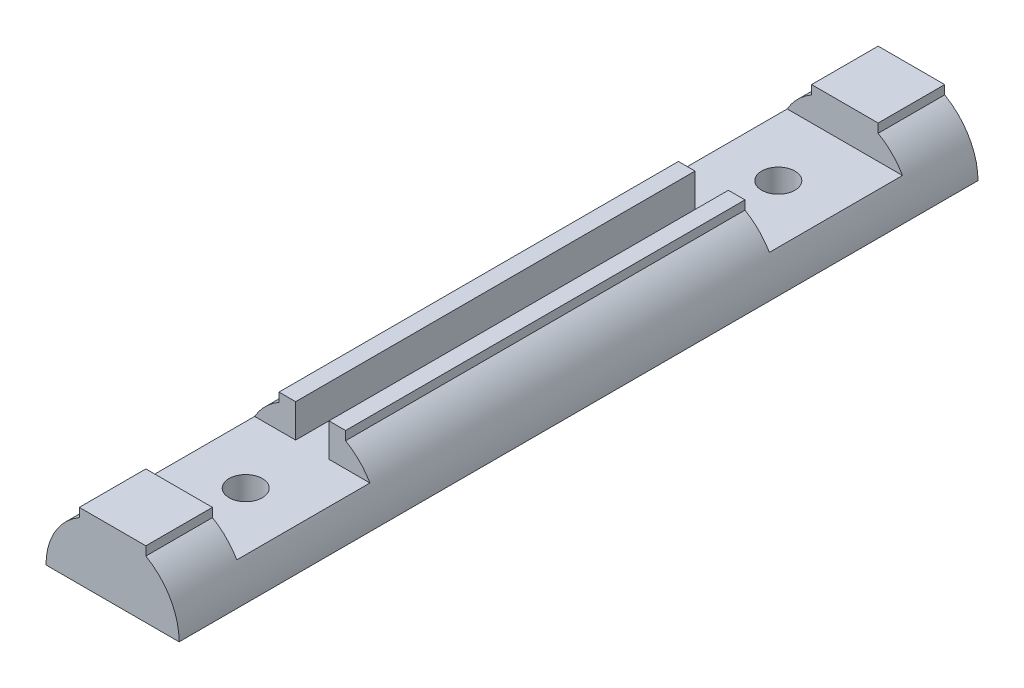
ISO-10303-21;
HEADER;
FILE_DESCRIPTION(('STEP AP214'),'2;1');
FILE_NAME('part.step','',(''),(''),'','','');
FILE_SCHEMA(('AUTOMOTIVE_DESIGN { 1 0 10303 214 1 1 1 1 }'));
ENDSEC;
DATA;
#1=APPLICATION_CONTEXT('core data for automotive mechanical design processes');
#2=APPLICATION_PROTOCOL_DEFINITION('international standard','automotive_design',2000,#1);
#3=PRODUCT_CONTEXT('',#1,'mechanical');
#4=PRODUCT('Part','Part','',(#3));
#5=PRODUCT_RELATED_PRODUCT_CATEGORY('part','',(#4));
#6=PRODUCT_DEFINITION_FORMATION('','',#4);
#7=PRODUCT_DEFINITION_CONTEXT('part definition',#1,'design');
#8=PRODUCT_DEFINITION('design','',#6,#7);
#9=PRODUCT_DEFINITION_SHAPE('','',#8);
#10=(LENGTH_UNIT() NAMED_UNIT(*) SI_UNIT(.MILLI.,.METRE.));
#11=(NAMED_UNIT(*) PLANE_ANGLE_UNIT() SI_UNIT($,.RADIAN.));
#12=(NAMED_UNIT(*) SI_UNIT($,.STERADIAN.) SOLID_ANGLE_UNIT());
#13=UNCERTAINTY_MEASURE_WITH_UNIT(LENGTH_MEASURE(1.E-05),#10,'distance_accuracy_value','');
#14=(GEOMETRIC_REPRESENTATION_CONTEXT(3) GLOBAL_UNCERTAINTY_ASSIGNED_CONTEXT((#13)) GLOBAL_UNIT_ASSIGNED_CONTEXT((#10,
#11,#12)) REPRESENTATION_CONTEXT('',''));
#15=CARTESIAN_POINT('',(0.,0.,0.));
#16=DIRECTION('',(0.,0.,1.));
#17=DIRECTION('',(1.,0.,0.));
#18=AXIS2_PLACEMENT_3D('',#15,#16,#17);
#19=CARTESIAN_POINT('',(5.,10.,-82.3606797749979));
#20=DIRECTION('',(0.,1.,0.));
#21=DIRECTION('',(0.,0.,1.));
#22=AXIS2_PLACEMENT_3D('',#19,#20,#21);
#23=PLANE('',#22);
#24=DIRECTION('',(0.,0.,-1.));
#25=VECTOR('',#24,1.);
#26=CARTESIAN_POINT('',(2.5,10.,30.));
#27=LINE('',#26,#25);
#28=CARTESIAN_POINT('',(2.5,10.,30.));
#29=VERTEX_POINT('',#28);
#30=CARTESIAN_POINT('',(2.5,10.,-30.));
#31=VERTEX_POINT('',#30);
#32=EDGE_CURVE('E239',#29,#31,#27,.T.);
#33=ORIENTED_EDGE('',*,*,#32,.F.);
#34=DIRECTION('',(-1.,0.,0.));
#35=VECTOR('',#34,1.);
#36=CARTESIAN_POINT('',(8.66025403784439,10.,30.));
#37=LINE('',#36,#35);
#38=CARTESIAN_POINT('',(5.,10.,30.));
#39=VERTEX_POINT('',#38);
#40=EDGE_CURVE('E227',#39,#29,#37,.T.);
#41=ORIENTED_EDGE('',*,*,#40,.F.);
#42=DIRECTION('',(0.,0.,1.));
#43=VECTOR('',#42,1.);
#44=CARTESIAN_POINT('',(5.,10.,-82.3606797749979));
#45=LINE('',#44,#43);
#46=CARTESIAN_POINT('',(5.,10.,-30.));
#47=VERTEX_POINT('',#46);
#48=EDGE_CURVE('E238',#47,#39,#45,.T.);
#49=ORIENTED_EDGE('',*,*,#48,.F.);
#50=DIRECTION('',(-1.,0.,0.));
#51=VECTOR('',#50,1.);
#52=CARTESIAN_POINT('',(8.66025403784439,10.,-30.));
#53=LINE('',#52,#51);
#54=EDGE_CURVE('E352',#47,#31,#53,.T.);
#55=ORIENTED_EDGE('',*,*,#54,.T.);
#56=EDGE_LOOP('',(#33,#41,#49,#55));
#57=FACE_BOUND('',#56,.T.);
#58=ADVANCED_FACE('F33',(#57),#23,.T.);
#59=CARTESIAN_POINT('',(0.,0.,-30.));
#60=DIRECTION('',(0.,0.,1.));
#61=DIRECTION('',(1.,0.,0.));
#62=AXIS2_PLACEMENT_3D('',#59,#60,#61);
#63=PLANE('',#62);
#64=DIRECTION('',(1.,0.,0.));
#65=VECTOR('',#64,1.);
#66=CARTESIAN_POINT('',(8.66025403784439,5.,-30.));
#67=LINE('',#66,#65);
#68=CARTESIAN_POINT('',(2.5,5.,-30.));
#69=VERTEX_POINT('',#68);
#70=CARTESIAN_POINT('',(8.66025403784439,5.,-30.));
#71=VERTEX_POINT('',#70);
#72=EDGE_CURVE('E347',#69,#71,#67,.T.);
#73=ORIENTED_EDGE('',*,*,#72,.F.);
#74=DIRECTION('',(0.,1.,0.));
#75=VECTOR('',#74,1.);
#76=CARTESIAN_POINT('',(2.5,-55.2079728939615,-30.));
#77=LINE('',#76,#75);
#78=EDGE_CURVE('E311',#69,#31,#77,.T.);
#79=ORIENTED_EDGE('',*,*,#78,.T.);
#80=ORIENTED_EDGE('',*,*,#54,.F.);
#81=DIRECTION('',(0.,-1.,0.));
#82=VECTOR('',#81,1.);
#83=CARTESIAN_POINT('',(5.,-10.,-30.));
#84=LINE('',#83,#82);
#85=CARTESIAN_POINT('',(5.,8.66025403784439,-30.));
#86=VERTEX_POINT('',#85);
#87=EDGE_CURVE('E215',#47,#86,#84,.T.);
#88=ORIENTED_EDGE('',*,*,#87,.T.);
#89=CARTESIAN_POINT('',(0.,0.,-30.));
#90=DIRECTION('',(0.,0.,1.));
#91=DIRECTION('',(1.,0.,0.));
#92=AXIS2_PLACEMENT_3D('',#89,#90,#91);
#93=CIRCLE('',#92,10.);
#94=EDGE_CURVE('E363',#71,#86,#93,.T.);
#95=ORIENTED_EDGE('',*,*,#94,.F.);
#96=EDGE_LOOP('',(#73,#79,#80,#88,#95));
#97=FACE_BOUND('',#96,.T.);
#98=ADVANCED_FACE('F407',(#97),#63,.F.);
#99=CARTESIAN_POINT('',(0.,0.,30.));
#100=DIRECTION('',(0.,0.,-1.));
#101=DIRECTION('',(1.,0.,0.));
#102=AXIS2_PLACEMENT_3D('',#99,#100,#101);
#103=PLANE('',#102);
#104=ORIENTED_EDGE('',*,*,#40,.T.);
#105=DIRECTION('',(0.,1.,0.));
#106=VECTOR('',#105,1.);
#107=CARTESIAN_POINT('',(2.5,-55.2079728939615,30.));
#108=LINE('',#107,#106);
#109=CARTESIAN_POINT('',(2.5,5.,30.));
#110=VERTEX_POINT('',#109);
#111=EDGE_CURVE('E302',#110,#29,#108,.T.);
#112=ORIENTED_EDGE('',*,*,#111,.F.);
#113=DIRECTION('',(1.,0.,0.));
#114=VECTOR('',#113,1.);
#115=CARTESIAN_POINT('',(8.66025403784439,5.,30.));
#116=LINE('',#115,#114);
#117=CARTESIAN_POINT('',(8.66025403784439,5.,30.));
#118=VERTEX_POINT('',#117);
#119=EDGE_CURVE('E240',#110,#118,#116,.T.);
#120=ORIENTED_EDGE('',*,*,#119,.T.);
#121=CARTESIAN_POINT('',(0.,0.,30.));
#122=DIRECTION('',(0.,0.,-1.));
#123=DIRECTION('',(-1.,0.,0.));
#124=AXIS2_PLACEMENT_3D('',#121,#122,#123);
#125=CIRCLE('',#124,10.);
#126=CARTESIAN_POINT('',(5.,8.66025403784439,30.));
#127=VERTEX_POINT('',#126);
#128=EDGE_CURVE('E229',#127,#118,#125,.T.);
#129=ORIENTED_EDGE('',*,*,#128,.F.);
#130=DIRECTION('',(0.,1.,0.));
#131=VECTOR('',#130,1.);
#132=CARTESIAN_POINT('',(5.,-10.,30.));
#133=LINE('',#132,#131);
#134=EDGE_CURVE('E42',#127,#39,#133,.T.);
#135=ORIENTED_EDGE('',*,*,#134,.T.);
#136=EDGE_LOOP('',(#104,#112,#120,#129,#135));
#137=FACE_BOUND('',#136,.T.);
#138=ADVANCED_FACE('F225',(#137),#103,.F.);
#139=CARTESIAN_POINT('',(0.,0.,60.));
#140=DIRECTION('',(0.,0.,-1.));
#141=DIRECTION('',(-1.,0.,0.));
#142=AXIS2_PLACEMENT_3D('',#139,#140,#141);
#143=CYLINDRICAL_SURFACE('',#142,10.);
#144=CARTESIAN_POINT('',(0.,0.,-60.));
#145=DIRECTION('',(0.,0.,1.));
#146=DIRECTION('',(1.,0.,0.));
#147=AXIS2_PLACEMENT_3D('',#144,#145,#146);
#148=CIRCLE('',#147,10.);
#149=CARTESIAN_POINT('',(-5.,8.66025403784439,-60.));
#150=VERTEX_POINT('',#149);
#151=CARTESIAN_POINT('',(-10.,0.,-60.));
#152=VERTEX_POINT('',#151);
#153=EDGE_CURVE('E206',#150,#152,#148,.T.);
#154=ORIENTED_EDGE('',*,*,#153,.T.);
#155=DIRECTION('',(0.,0.,1.));
#156=VECTOR('',#155,1.);
#157=CARTESIAN_POINT('',(-10.,0.,-60.));
#158=LINE('',#157,#156);
#159=CARTESIAN_POINT('',(-10.,0.,60.));
#160=VERTEX_POINT('',#159);
#161=EDGE_CURVE('E49',#152,#160,#158,.T.);
#162=ORIENTED_EDGE('',*,*,#161,.T.);
#163=CARTESIAN_POINT('',(0.,0.,60.));
#164=DIRECTION('',(0.,0.,1.));
#165=DIRECTION('',(1.,0.,0.));
#166=AXIS2_PLACEMENT_3D('',#163,#164,#165);
#167=CIRCLE('',#166,10.);
#168=CARTESIAN_POINT('',(-5.,8.66025403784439,60.));
#169=VERTEX_POINT('',#168);
#170=EDGE_CURVE('E218',#169,#160,#167,.T.);
#171=ORIENTED_EDGE('',*,*,#170,.F.);
#172=DIRECTION('',(0.,0.,-1.));
#173=VECTOR('',#172,1.);
#174=CARTESIAN_POINT('',(-5.,8.66025403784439,60.));
#175=LINE('',#174,#173);
#176=CARTESIAN_POINT('',(-5.,8.66025403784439,50.));
#177=VERTEX_POINT('',#176);
#178=EDGE_CURVE('E207',#169,#177,#175,.T.);
#179=ORIENTED_EDGE('',*,*,#178,.T.);
#180=CARTESIAN_POINT('',(0.,0.,50.));
#181=DIRECTION('',(0.,0.,-1.));
#182=DIRECTION('',(-1.,0.,0.));
#183=AXIS2_PLACEMENT_3D('',#180,#181,#182);
#184=CIRCLE('',#183,10.);
#185=CARTESIAN_POINT('',(-8.66025403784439,5.,50.));
#186=VERTEX_POINT('',#185);
#187=EDGE_CURVE('E294',#186,#177,#184,.T.);
#188=ORIENTED_EDGE('',*,*,#187,.F.);
#189=DIRECTION('',(0.,0.,-1.));
#190=VECTOR('',#189,1.);
#191=CARTESIAN_POINT('',(-8.66025403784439,5.,50.));
#192=LINE('',#191,#190);
#193=CARTESIAN_POINT('',(-8.66025403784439,5.,30.));
#194=VERTEX_POINT('',#193);
#195=EDGE_CURVE('E330',#186,#194,#192,.T.);
#196=ORIENTED_EDGE('',*,*,#195,.T.);
#197=CARTESIAN_POINT('',(0.,0.,30.));
#198=DIRECTION('',(0.,0.,-1.));
#199=DIRECTION('',(-1.,0.,0.));
#200=AXIS2_PLACEMENT_3D('',#197,#198,#199);
#201=CIRCLE('',#200,10.);
#202=CARTESIAN_POINT('',(-5.,8.66025403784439,30.));
#203=VERTEX_POINT('',#202);
#204=EDGE_CURVE('E337',#194,#203,#201,.T.);
#205=ORIENTED_EDGE('',*,*,#204,.T.);
#206=CARTESIAN_POINT('',(-5.,8.66025403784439,-30.));
#207=VERTEX_POINT('',#206);
#208=EDGE_CURVE('E210',#203,#207,#175,.T.);
#209=ORIENTED_EDGE('',*,*,#208,.T.);
#210=CARTESIAN_POINT('',(0.,0.,-30.));
#211=DIRECTION('',(0.,0.,1.));
#212=DIRECTION('',(1.,0.,0.));
#213=AXIS2_PLACEMENT_3D('',#210,#211,#212);
#214=CIRCLE('',#213,10.);
#215=CARTESIAN_POINT('',(-8.66025403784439,5.,-30.));
#216=VERTEX_POINT('',#215);
#217=EDGE_CURVE('E370',#207,#216,#214,.T.);
#218=ORIENTED_EDGE('',*,*,#217,.T.);
#219=DIRECTION('',(0.,0.,1.));
#220=VECTOR('',#219,1.);
#221=CARTESIAN_POINT('',(-8.66025403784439,5.,-50.));
#222=LINE('',#221,#220);
#223=CARTESIAN_POINT('',(-8.66025403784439,5.,-50.));
#224=VERTEX_POINT('',#223);
#225=EDGE_CURVE('E354',#224,#216,#222,.T.);
#226=ORIENTED_EDGE('',*,*,#225,.F.);
#227=CARTESIAN_POINT('',(0.,0.,-50.));
#228=DIRECTION('',(0.,0.,1.));
#229=DIRECTION('',(1.,0.,0.));
#230=AXIS2_PLACEMENT_3D('',#227,#228,#229);
#231=CIRCLE('',#230,10.);
#232=CARTESIAN_POINT('',(-5.,8.66025403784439,-50.));
#233=VERTEX_POINT('',#232);
#234=EDGE_CURVE('E275',#233,#224,#231,.T.);
#235=ORIENTED_EDGE('',*,*,#234,.F.);
#236=EDGE_CURVE('E212',#233,#150,#175,.T.);
#237=ORIENTED_EDGE('',*,*,#236,.T.);
#238=EDGE_LOOP('',(#154,#162,#171,#179,#188,#196,#205,#209,#218,#226,#235,#237));
#239=FACE_BOUND('',#238,.T.);
#240=ADVANCED_FACE('F35',(#239),#143,.T.);
#241=CARTESIAN_POINT('',(10.,0.,60.));
#242=VERTEX_POINT('',#241);
#243=CARTESIAN_POINT('',(5.,8.66025403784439,60.));
#244=VERTEX_POINT('',#243);
#245=EDGE_CURVE('E200',#242,#244,#167,.T.);
#246=ORIENTED_EDGE('',*,*,#245,.F.);
#247=DIRECTION('',(0.,0.,1.));
#248=VECTOR('',#247,1.);
#249=CARTESIAN_POINT('',(10.,0.,-60.));
#250=LINE('',#249,#248);
#251=CARTESIAN_POINT('',(10.,0.,-60.));
#252=VERTEX_POINT('',#251);
#253=EDGE_CURVE('E185',#252,#242,#250,.T.);
#254=ORIENTED_EDGE('',*,*,#253,.F.);
#255=CARTESIAN_POINT('',(5.,8.66025403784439,-60.));
#256=VERTEX_POINT('',#255);
#257=EDGE_CURVE('E197',#252,#256,#148,.T.);
#258=ORIENTED_EDGE('',*,*,#257,.T.);
#259=DIRECTION('',(0.,0.,-1.));
#260=VECTOR('',#259,1.);
#261=CARTESIAN_POINT('',(5.,8.66025403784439,60.));
#262=LINE('',#261,#260);
#263=CARTESIAN_POINT('',(5.,8.66025403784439,-50.));
#264=VERTEX_POINT('',#263);
#265=EDGE_CURVE('E255',#256,#264,#262,.F.);
#266=ORIENTED_EDGE('',*,*,#265,.T.);
#267=CARTESIAN_POINT('',(0.,0.,-50.));
#268=DIRECTION('',(0.,0.,1.));
#269=DIRECTION('',(1.,0.,0.));
#270=AXIS2_PLACEMENT_3D('',#267,#268,#269);
#271=CIRCLE('',#270,10.);
#272=CARTESIAN_POINT('',(8.66025403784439,5.,-50.));
#273=VERTEX_POINT('',#272);
#274=EDGE_CURVE('E373',#273,#264,#271,.T.);
#275=ORIENTED_EDGE('',*,*,#274,.F.);
#276=DIRECTION('',(0.,0.,1.));
#277=VECTOR('',#276,1.);
#278=CARTESIAN_POINT('',(8.66025403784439,5.,-50.));
#279=LINE('',#278,#277);
#280=EDGE_CURVE('E360',#273,#71,#279,.T.);
#281=ORIENTED_EDGE('',*,*,#280,.T.);
#282=ORIENTED_EDGE('',*,*,#94,.T.);
#283=EDGE_CURVE('E256',#86,#127,#262,.F.);
#284=ORIENTED_EDGE('',*,*,#283,.T.);
#285=ORIENTED_EDGE('',*,*,#128,.T.);
#286=DIRECTION('',(0.,0.,-1.));
#287=VECTOR('',#286,1.);
#288=CARTESIAN_POINT('',(8.66025403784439,5.,50.));
#289=LINE('',#288,#287);
#290=CARTESIAN_POINT('',(8.66025403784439,5.,50.));
#291=VERTEX_POINT('',#290);
#292=EDGE_CURVE('E326',#291,#118,#289,.T.);
#293=ORIENTED_EDGE('',*,*,#292,.F.);
#294=CARTESIAN_POINT('',(0.,0.,50.));
#295=DIRECTION('',(0.,0.,-1.));
#296=DIRECTION('',(-1.,0.,0.));
#297=AXIS2_PLACEMENT_3D('',#294,#295,#296);
#298=CIRCLE('',#297,10.);
#299=CARTESIAN_POINT('',(5.,8.66025403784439,50.));
#300=VERTEX_POINT('',#299);
#301=EDGE_CURVE('E340',#300,#291,#298,.T.);
#302=ORIENTED_EDGE('',*,*,#301,.F.);
#303=EDGE_CURVE('E257',#300,#244,#262,.F.);
#304=ORIENTED_EDGE('',*,*,#303,.T.);
#305=EDGE_LOOP('',(#246,#254,#258,#266,#275,#281,#282,#284,#285,#293,#302,#304));
#306=FACE_BOUND('',#305,.T.);
#307=ADVANCED_FACE('F195',(#306),#143,.T.);
#308=CARTESIAN_POINT('',(-5.,-10.,-82.3606797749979));
#309=DIRECTION('',(-1.,0.,0.));
#310=DIRECTION('',(0.,0.,1.));
#311=AXIS2_PLACEMENT_3D('',#308,#309,#310);
#312=PLANE('',#311);
#313=DIRECTION('',(0.,0.,1.));
#314=VECTOR('',#313,1.);
#315=CARTESIAN_POINT('',(-5.,10.,-82.3606797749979));
#316=LINE('',#315,#314);
#317=CARTESIAN_POINT('',(-5.,10.,50.));
#318=VERTEX_POINT('',#317);
#319=CARTESIAN_POINT('',(-5.,10.,60.));
#320=VERTEX_POINT('',#319);
#321=EDGE_CURVE('E249',#318,#320,#316,.T.);
#322=ORIENTED_EDGE('',*,*,#321,.F.);
#323=DIRECTION('',(0.,-1.,0.));
#324=VECTOR('',#323,1.);
#325=CARTESIAN_POINT('',(-5.,-10.,50.));
#326=LINE('',#325,#324);
#327=EDGE_CURVE('E290',#318,#177,#326,.T.);
#328=ORIENTED_EDGE('',*,*,#327,.T.);
#329=ORIENTED_EDGE('',*,*,#178,.F.);
#330=DIRECTION('',(0.,-1.,0.));
#331=VECTOR('',#330,1.);
#332=CARTESIAN_POINT('',(-5.,-10.,60.));
#333=LINE('',#332,#331);
#334=EDGE_CURVE('E271',#320,#169,#333,.T.);
#335=ORIENTED_EDGE('',*,*,#334,.F.);
#336=EDGE_LOOP('',(#322,#328,#329,#335));
#337=FACE_BOUND('',#336,.T.);
#338=ADVANCED_FACE('F288',(#337),#312,.T.);
#339=CARTESIAN_POINT('',(5.,10.,50.));
#340=VERTEX_POINT('',#339);
#341=CARTESIAN_POINT('',(5.,10.,60.));
#342=VERTEX_POINT('',#341);
#343=EDGE_CURVE('E246',#340,#342,#45,.T.);
#344=ORIENTED_EDGE('',*,*,#343,.F.);
#345=DIRECTION('',(-1.,0.,0.));
#346=VECTOR('',#345,1.);
#347=CARTESIAN_POINT('',(8.66025403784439,10.,50.));
#348=LINE('',#347,#346);
#349=EDGE_CURVE('E320',#340,#318,#348,.T.);
#350=ORIENTED_EDGE('',*,*,#349,.T.);
#351=ORIENTED_EDGE('',*,*,#321,.T.);
#352=DIRECTION('',(-1.,0.,0.));
#353=VECTOR('',#352,1.);
#354=CARTESIAN_POINT('',(5.,10.,60.));
#355=LINE('',#354,#353);
#356=EDGE_CURVE('E250',#342,#320,#355,.T.);
#357=ORIENTED_EDGE('',*,*,#356,.F.);
#358=EDGE_LOOP('',(#344,#350,#351,#357));
#359=FACE_BOUND('',#358,.T.);
#360=ADVANCED_FACE('F383',(#359),#23,.T.);
#361=CARTESIAN_POINT('',(5.,-10.,-82.3606797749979));
#362=DIRECTION('',(1.,0.,0.));
#363=DIRECTION('',(0.,0.,-1.));
#364=AXIS2_PLACEMENT_3D('',#361,#362,#363);
#365=PLANE('',#364);
#366=ORIENTED_EDGE('',*,*,#303,.F.);
#367=DIRECTION('',(0.,1.,0.));
#368=VECTOR('',#367,1.);
#369=CARTESIAN_POINT('',(5.,-10.,50.));
#370=LINE('',#369,#368);
#371=EDGE_CURVE('E12',#300,#340,#370,.T.);
#372=ORIENTED_EDGE('',*,*,#371,.T.);
#373=ORIENTED_EDGE('',*,*,#343,.T.);
#374=DIRECTION('',(0.,1.,0.));
#375=VECTOR('',#374,1.);
#376=CARTESIAN_POINT('',(5.,-10.,60.));
#377=LINE('',#376,#375);
#378=EDGE_CURVE('E274',#244,#342,#377,.T.);
#379=ORIENTED_EDGE('',*,*,#378,.F.);
#380=EDGE_LOOP('',(#366,#372,#373,#379));
#381=FACE_BOUND('',#380,.T.);
#382=ADVANCED_FACE('F387',(#381),#365,.T.);
#383=ORIENTED_EDGE('',*,*,#236,.F.);
#384=DIRECTION('',(0.,1.,0.));
#385=VECTOR('',#384,1.);
#386=CARTESIAN_POINT('',(-5.,-10.,-50.));
#387=LINE('',#386,#385);
#388=CARTESIAN_POINT('',(-5.,10.,-50.));
#389=VERTEX_POINT('',#388);
#390=EDGE_CURVE('E375',#233,#389,#387,.T.);
#391=ORIENTED_EDGE('',*,*,#390,.T.);
#392=CARTESIAN_POINT('',(-5.,10.,-60.));
#393=VERTEX_POINT('',#392);
#394=EDGE_CURVE('E253',#393,#389,#316,.T.);
#395=ORIENTED_EDGE('',*,*,#394,.F.);
#396=DIRECTION('',(0.,1.,0.));
#397=VECTOR('',#396,1.);
#398=CARTESIAN_POINT('',(-5.,-10.,-60.));
#399=LINE('',#398,#397);
#400=EDGE_CURVE('E259',#150,#393,#399,.T.);
#401=ORIENTED_EDGE('',*,*,#400,.F.);
#402=EDGE_LOOP('',(#383,#391,#395,#401));
#403=FACE_BOUND('',#402,.T.);
#404=ADVANCED_FACE('F389',(#403),#312,.T.);
#405=ORIENTED_EDGE('',*,*,#394,.T.);
#406=DIRECTION('',(-1.,0.,0.));
#407=VECTOR('',#406,1.);
#408=CARTESIAN_POINT('',(8.66025403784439,10.,-50.));
#409=LINE('',#408,#407);
#410=CARTESIAN_POINT('',(5.,10.,-50.));
#411=VERTEX_POINT('',#410);
#412=EDGE_CURVE('E351',#411,#389,#409,.T.);
#413=ORIENTED_EDGE('',*,*,#412,.F.);
#414=CARTESIAN_POINT('',(5.,10.,-60.));
#415=VERTEX_POINT('',#414);
#416=EDGE_CURVE('E245',#415,#411,#45,.T.);
#417=ORIENTED_EDGE('',*,*,#416,.F.);
#418=DIRECTION('',(1.,0.,0.));
#419=VECTOR('',#418,1.);
#420=CARTESIAN_POINT('',(5.,10.,-60.));
#421=LINE('',#420,#419);
#422=EDGE_CURVE('E264',#393,#415,#421,.T.);
#423=ORIENTED_EDGE('',*,*,#422,.F.);
#424=EDGE_LOOP('',(#405,#413,#417,#423));
#425=FACE_BOUND('',#424,.T.);
#426=ADVANCED_FACE('F396',(#425),#23,.T.);
#427=ORIENTED_EDGE('',*,*,#416,.T.);
#428=DIRECTION('',(0.,-1.,0.));
#429=VECTOR('',#428,1.);
#430=CARTESIAN_POINT('',(5.,-10.,-50.));
#431=LINE('',#430,#429);
#432=EDGE_CURVE('E217',#411,#264,#431,.T.);
#433=ORIENTED_EDGE('',*,*,#432,.T.);
#434=ORIENTED_EDGE('',*,*,#265,.F.);
#435=DIRECTION('',(0.,-1.,0.));
#436=VECTOR('',#435,1.);
#437=CARTESIAN_POINT('',(5.,-10.,-60.));
#438=LINE('',#437,#436);
#439=EDGE_CURVE('E205',#415,#256,#438,.T.);
#440=ORIENTED_EDGE('',*,*,#439,.F.);
#441=EDGE_LOOP('',(#427,#433,#434,#440));
#442=FACE_BOUND('',#441,.T.);
#443=ADVANCED_FACE('F391',(#442),#365,.T.);
#444=CARTESIAN_POINT('',(0.,0.,60.));
#445=DIRECTION('',(0.,0.,1.));
#446=DIRECTION('',(1.,0.,0.));
#447=AXIS2_PLACEMENT_3D('',#444,#445,#446);
#448=PLANE('',#447);
#449=DIRECTION('',(-1.,0.,0.));
#450=VECTOR('',#449,1.);
#451=CARTESIAN_POINT('',(10.,0.,60.));
#452=LINE('',#451,#450);
#453=EDGE_CURVE('E191',#242,#160,#452,.T.);
#454=ORIENTED_EDGE('',*,*,#453,.F.);
#455=ORIENTED_EDGE('',*,*,#245,.T.);
#456=ORIENTED_EDGE('',*,*,#378,.T.);
#457=ORIENTED_EDGE('',*,*,#356,.T.);
#458=ORIENTED_EDGE('',*,*,#334,.T.);
#459=ORIENTED_EDGE('',*,*,#170,.T.);
#460=EDGE_LOOP('',(#454,#455,#456,#457,#458,#459));
#461=FACE_BOUND('',#460,.T.);
#462=ADVANCED_FACE('F281',(#461),#448,.T.);
#463=CARTESIAN_POINT('',(0.,0.,-60.));
#464=DIRECTION('',(0.,0.,1.));
#465=DIRECTION('',(1.,0.,0.));
#466=AXIS2_PLACEMENT_3D('',#463,#464,#465);
#467=PLANE('',#466);
#468=ORIENTED_EDGE('',*,*,#257,.F.);
#469=DIRECTION('',(-1.,0.,0.));
#470=VECTOR('',#469,1.);
#471=CARTESIAN_POINT('',(10.,0.,-60.));
#472=LINE('',#471,#470);
#473=EDGE_CURVE('E181',#252,#152,#472,.T.);
#474=ORIENTED_EDGE('',*,*,#473,.T.);
#475=ORIENTED_EDGE('',*,*,#153,.F.);
#476=ORIENTED_EDGE('',*,*,#400,.T.);
#477=ORIENTED_EDGE('',*,*,#422,.T.);
#478=ORIENTED_EDGE('',*,*,#439,.T.);
#479=EDGE_LOOP('',(#468,#474,#475,#476,#477,#478));
#480=FACE_BOUND('',#479,.T.);
#481=ADVANCED_FACE('F203',(#480),#467,.F.);
#482=DIRECTION('',(0.,-1.,0.));
#483=VECTOR('',#482,1.);
#484=CARTESIAN_POINT('',(-5.,-10.,30.));
#485=LINE('',#484,#483);
#486=CARTESIAN_POINT('',(-5.,10.,30.));
#487=VERTEX_POINT('',#486);
#488=EDGE_CURVE('E335',#487,#203,#485,.T.);
#489=ORIENTED_EDGE('',*,*,#488,.F.);
#490=CARTESIAN_POINT('',(-5.,10.,-30.));
#491=VERTEX_POINT('',#490);
#492=EDGE_CURVE('E379',#491,#487,#316,.T.);
#493=ORIENTED_EDGE('',*,*,#492,.F.);
#494=DIRECTION('',(0.,1.,0.));
#495=VECTOR('',#494,1.);
#496=CARTESIAN_POINT('',(-5.,-10.,-30.));
#497=LINE('',#496,#495);
#498=EDGE_CURVE('E367',#207,#491,#497,.T.);
#499=ORIENTED_EDGE('',*,*,#498,.F.);
#500=ORIENTED_EDGE('',*,*,#208,.F.);
#501=EDGE_LOOP('',(#489,#493,#499,#500));
#502=FACE_BOUND('',#501,.T.);
#503=ADVANCED_FACE('F399',(#502),#312,.T.);
#504=DIRECTION('',(0.,0.,1.));
#505=VECTOR('',#504,1.);
#506=CARTESIAN_POINT('',(-2.5,10.,30.));
#507=LINE('',#506,#505);
#508=CARTESIAN_POINT('',(-2.5,10.,-30.));
#509=VERTEX_POINT('',#508);
#510=CARTESIAN_POINT('',(-2.5,10.,30.));
#511=VERTEX_POINT('',#510);
#512=EDGE_CURVE('E57',#509,#511,#507,.T.);
#513=ORIENTED_EDGE('',*,*,#512,.F.);
#514=EDGE_CURVE('E358',#509,#491,#53,.T.);
#515=ORIENTED_EDGE('',*,*,#514,.T.);
#516=ORIENTED_EDGE('',*,*,#492,.T.);
#517=EDGE_CURVE('E241',#511,#487,#37,.T.);
#518=ORIENTED_EDGE('',*,*,#517,.F.);
#519=EDGE_LOOP('',(#513,#515,#516,#518));
#520=FACE_BOUND('',#519,.T.);
#521=ADVANCED_FACE('F405',(#520),#23,.T.);
#522=ORIENTED_EDGE('',*,*,#134,.F.);
#523=ORIENTED_EDGE('',*,*,#283,.F.);
#524=ORIENTED_EDGE('',*,*,#87,.F.);
#525=ORIENTED_EDGE('',*,*,#48,.T.);
#526=EDGE_LOOP('',(#522,#523,#524,#525));
#527=FACE_BOUND('',#526,.T.);
#528=ADVANCED_FACE('F244',(#527),#365,.T.);
#529=CARTESIAN_POINT('',(0.,0.,-50.));
#530=DIRECTION('',(0.,0.,1.));
#531=DIRECTION('',(1.,0.,0.));
#532=AXIS2_PLACEMENT_3D('',#529,#530,#531);
#533=PLANE('',#532);
#534=ORIENTED_EDGE('',*,*,#234,.T.);
#535=DIRECTION('',(1.,0.,0.));
#536=VECTOR('',#535,1.);
#537=CARTESIAN_POINT('',(8.66025403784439,5.,-50.));
#538=LINE('',#537,#536);
#539=EDGE_CURVE('E348',#224,#273,#538,.T.);
#540=ORIENTED_EDGE('',*,*,#539,.T.);
#541=ORIENTED_EDGE('',*,*,#274,.T.);
#542=ORIENTED_EDGE('',*,*,#432,.F.);
#543=ORIENTED_EDGE('',*,*,#412,.T.);
#544=ORIENTED_EDGE('',*,*,#390,.F.);
#545=EDGE_LOOP('',(#534,#540,#541,#542,#543,#544));
#546=FACE_BOUND('',#545,.T.);
#547=ADVANCED_FACE('F404',(#546),#533,.T.);
#548=ORIENTED_EDGE('',*,*,#514,.F.);
#549=DIRECTION('',(0.,1.,0.));
#550=VECTOR('',#549,1.);
#551=CARTESIAN_POINT('',(-2.5,-55.2079728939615,-30.));
#552=LINE('',#551,#550);
#553=CARTESIAN_POINT('',(-2.5,5.,-30.));
#554=VERTEX_POINT('',#553);
#555=EDGE_CURVE('E307',#554,#509,#552,.T.);
#556=ORIENTED_EDGE('',*,*,#555,.F.);
#557=EDGE_CURVE('E355',#216,#554,#67,.T.);
#558=ORIENTED_EDGE('',*,*,#557,.F.);
#559=ORIENTED_EDGE('',*,*,#217,.F.);
#560=ORIENTED_EDGE('',*,*,#498,.T.);
#561=EDGE_LOOP('',(#548,#556,#558,#559,#560));
#562=FACE_BOUND('',#561,.T.);
#563=ADVANCED_FACE('F413',(#562),#63,.F.);
#564=CARTESIAN_POINT('',(8.66025403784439,5.,-50.));
#565=DIRECTION('',(0.,-1.,0.));
#566=DIRECTION('',(0.,0.,-1.));
#567=AXIS2_PLACEMENT_3D('',#564,#565,#566);
#568=PLANE('',#567);
#569=CARTESIAN_POINT('',(0.,5.,-40.));
#570=DIRECTION('',(0.,1.,0.));
#571=DIRECTION('',(0.,0.,1.));
#572=AXIS2_PLACEMENT_3D('',#569,#570,#571);
#573=CIRCLE('',#572,2.5);
#574=CARTESIAN_POINT('',(0.,5.,-37.5));
#575=VERTEX_POINT('',#574);
#576=EDGE_CURVE('E344',#575,#575,#573,.T.);
#577=ORIENTED_EDGE('',*,*,#576,.F.);
#578=EDGE_LOOP('',(#577));
#579=FACE_BOUND('',#578,.T.);
#580=ORIENTED_EDGE('',*,*,#557,.T.);
#581=DIRECTION('',(0.,0.,1.));
#582=VECTOR('',#581,1.);
#583=CARTESIAN_POINT('',(-2.5,5.,30.));
#584=LINE('',#583,#582);
#585=CARTESIAN_POINT('',(-2.5,5.,30.));
#586=VERTEX_POINT('',#585);
#587=EDGE_CURVE('E304',#554,#586,#584,.T.);
#588=ORIENTED_EDGE('',*,*,#587,.T.);
#589=EDGE_CURVE('E324',#194,#586,#116,.T.);
#590=ORIENTED_EDGE('',*,*,#589,.F.);
#591=ORIENTED_EDGE('',*,*,#195,.F.);
#592=DIRECTION('',(1.,0.,0.));
#593=VECTOR('',#592,1.);
#594=CARTESIAN_POINT('',(8.66025403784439,5.,50.));
#595=LINE('',#594,#593);
#596=EDGE_CURVE('E323',#186,#291,#595,.T.);
#597=ORIENTED_EDGE('',*,*,#596,.T.);
#598=ORIENTED_EDGE('',*,*,#292,.T.);
#599=ORIENTED_EDGE('',*,*,#119,.F.);
#600=DIRECTION('',(0.,0.,-1.));
#601=VECTOR('',#600,1.);
#602=CARTESIAN_POINT('',(2.5,5.,30.));
#603=LINE('',#602,#601);
#604=EDGE_CURVE('E308',#110,#69,#603,.T.);
#605=ORIENTED_EDGE('',*,*,#604,.T.);
#606=ORIENTED_EDGE('',*,*,#72,.T.);
#607=ORIENTED_EDGE('',*,*,#280,.F.);
#608=ORIENTED_EDGE('',*,*,#539,.F.);
#609=ORIENTED_EDGE('',*,*,#225,.T.);
#610=EDGE_LOOP('',(#580,#588,#590,#591,#597,#598,#599,#605,#606,#607,#608,#609));
#611=FACE_BOUND('',#610,.T.);
#612=CARTESIAN_POINT('',(0.,5.,40.));
#613=DIRECTION('',(0.,-1.,0.));
#614=DIRECTION('',(0.,0.,-1.));
#615=AXIS2_PLACEMENT_3D('',#612,#613,#614);
#616=CIRCLE('',#615,2.5);
#617=CARTESIAN_POINT('',(0.,5.,37.5));
#618=VERTEX_POINT('',#617);
#619=EDGE_CURVE('E317',#618,#618,#616,.T.);
#620=ORIENTED_EDGE('',*,*,#619,.T.);
#621=EDGE_LOOP('',(#620));
#622=FACE_BOUND('',#621,.T.);
#623=ADVANCED_FACE('F506',(#579,#611,#622),#568,.F.);
#624=CARTESIAN_POINT('',(0.,-10.,-40.));
#625=DIRECTION('',(0.,1.,0.));
#626=DIRECTION('',(0.,0.,1.));
#627=AXIS2_PLACEMENT_3D('',#624,#625,#626);
#628=CYLINDRICAL_SURFACE('',#627,2.5);
#629=CARTESIAN_POINT('',(0.,0.,-40.));
#630=DIRECTION('',(0.,1.,0.));
#631=DIRECTION('',(-1.,0.,0.));
#632=AXIS2_PLACEMENT_3D('',#629,#630,#631);
#633=CIRCLE('',#632,2.5);
#634=CARTESIAN_POINT('',(-2.5,0.,-40.));
#635=VERTEX_POINT('',#634);
#636=EDGE_CURVE('E298',#635,#635,#633,.F.);
#637=ORIENTED_EDGE('',*,*,#636,.T.);
#638=EDGE_LOOP('',(#637));
#639=FACE_BOUND('',#638,.T.);
#640=ORIENTED_EDGE('',*,*,#576,.T.);
#641=EDGE_LOOP('',(#640));
#642=FACE_BOUND('',#641,.T.);
#643=ADVANCED_FACE('F468',(#639,#642),#628,.F.);
#644=CARTESIAN_POINT('',(0.,0.,50.));
#645=DIRECTION('',(0.,0.,-1.));
#646=DIRECTION('',(1.,0.,0.));
#647=AXIS2_PLACEMENT_3D('',#644,#645,#646);
#648=PLANE('',#647);
#649=ORIENTED_EDGE('',*,*,#187,.T.);
#650=ORIENTED_EDGE('',*,*,#327,.F.);
#651=ORIENTED_EDGE('',*,*,#349,.F.);
#652=ORIENTED_EDGE('',*,*,#371,.F.);
#653=ORIENTED_EDGE('',*,*,#301,.T.);
#654=ORIENTED_EDGE('',*,*,#596,.F.);
#655=EDGE_LOOP('',(#649,#650,#651,#652,#653,#654));
#656=FACE_BOUND('',#655,.T.);
#657=ADVANCED_FACE('F385',(#656),#648,.T.);
#658=ORIENTED_EDGE('',*,*,#589,.T.);
#659=DIRECTION('',(0.,1.,0.));
#660=VECTOR('',#659,1.);
#661=CARTESIAN_POINT('',(-2.5,-55.2079728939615,30.));
#662=LINE('',#661,#660);
#663=EDGE_CURVE('E306',#586,#511,#662,.T.);
#664=ORIENTED_EDGE('',*,*,#663,.T.);
#665=ORIENTED_EDGE('',*,*,#517,.T.);
#666=ORIENTED_EDGE('',*,*,#488,.T.);
#667=ORIENTED_EDGE('',*,*,#204,.F.);
#668=EDGE_LOOP('',(#658,#664,#665,#666,#667));
#669=FACE_BOUND('',#668,.T.);
#670=ADVANCED_FACE('F467',(#669),#103,.F.);
#671=CARTESIAN_POINT('',(0.,-10.,40.));
#672=DIRECTION('',(0.,1.,0.));
#673=DIRECTION('',(0.,0.,1.));
#674=AXIS2_PLACEMENT_3D('',#671,#672,#673);
#675=CYLINDRICAL_SURFACE('',#674,2.5);
#676=CARTESIAN_POINT('',(0.,0.,40.));
#677=DIRECTION('',(0.,1.,0.));
#678=DIRECTION('',(-1.,0.,0.));
#679=AXIS2_PLACEMENT_3D('',#676,#677,#678);
#680=CIRCLE('',#679,2.5);
#681=CARTESIAN_POINT('',(-2.5,0.,40.));
#682=VERTEX_POINT('',#681);
#683=EDGE_CURVE('E37',#682,#682,#680,.T.);
#684=ORIENTED_EDGE('',*,*,#683,.F.);
#685=EDGE_LOOP('',(#684));
#686=FACE_BOUND('',#685,.T.);
#687=ORIENTED_EDGE('',*,*,#619,.F.);
#688=EDGE_LOOP('',(#687));
#689=FACE_BOUND('',#688,.T.);
#690=ADVANCED_FACE('F524',(#686,#689),#675,.F.);
#691=CARTESIAN_POINT('',(2.5,-55.2079728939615,30.));
#692=DIRECTION('',(1.,0.,0.));
#693=DIRECTION('',(0.,0.,-1.));
#694=AXIS2_PLACEMENT_3D('',#691,#692,#693);
#695=PLANE('',#694);
#696=ORIENTED_EDGE('',*,*,#111,.T.);
#697=ORIENTED_EDGE('',*,*,#32,.T.);
#698=ORIENTED_EDGE('',*,*,#78,.F.);
#699=ORIENTED_EDGE('',*,*,#604,.F.);
#700=EDGE_LOOP('',(#696,#697,#698,#699));
#701=FACE_BOUND('',#700,.T.);
#702=ADVANCED_FACE('F530',(#701),#695,.F.);
#703=CARTESIAN_POINT('',(-2.5,-55.2079728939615,30.));
#704=DIRECTION('',(-1.,0.,0.));
#705=DIRECTION('',(0.,0.,1.));
#706=AXIS2_PLACEMENT_3D('',#703,#704,#705);
#707=PLANE('',#706);
#708=ORIENTED_EDGE('',*,*,#555,.T.);
#709=ORIENTED_EDGE('',*,*,#512,.T.);
#710=ORIENTED_EDGE('',*,*,#663,.F.);
#711=ORIENTED_EDGE('',*,*,#587,.F.);
#712=EDGE_LOOP('',(#708,#709,#710,#711));
#713=FACE_BOUND('',#712,.T.);
#714=ADVANCED_FACE('F534',(#713),#707,.F.);
#715=CARTESIAN_POINT('',(10.,0.,-60.));
#716=DIRECTION('',(0.,1.,0.));
#717=DIRECTION('',(-1.,0.,0.));
#718=AXIS2_PLACEMENT_3D('',#715,#716,#717);
#719=PLANE('',#718);
#720=ORIENTED_EDGE('',*,*,#453,.T.);
#721=ORIENTED_EDGE('',*,*,#161,.F.);
#722=ORIENTED_EDGE('',*,*,#473,.F.);
#723=ORIENTED_EDGE('',*,*,#253,.T.);
#724=EDGE_LOOP('',(#720,#721,#722,#723));
#725=FACE_BOUND('',#724,.T.);
#726=ORIENTED_EDGE('',*,*,#683,.T.);
#727=EDGE_LOOP('',(#726));
#728=FACE_BOUND('',#727,.T.);
#729=ORIENTED_EDGE('',*,*,#636,.F.);
#730=EDGE_LOOP('',(#729));
#731=FACE_BOUND('',#730,.T.);
#732=ADVANCED_FACE('F183',(#725,#728,#731),#719,.F.);
#733=CLOSED_SHELL('',(#58,#98,#138,#240,#307,#338,#360,#382,#404,#426,#443,#462,#481,#503,#521,
#528,#547,#563,#623,#643,#657,#670,#690,#702,#714,#732));
#734=MANIFOLD_SOLID_BREP('B2',#733);
#735=ADVANCED_BREP_SHAPE_REPRESENTATION('',(#18,#734),#14);
#736=SHAPE_DEFINITION_REPRESENTATION(#9,#735);
ENDSEC;
END-ISO-10303-21;
